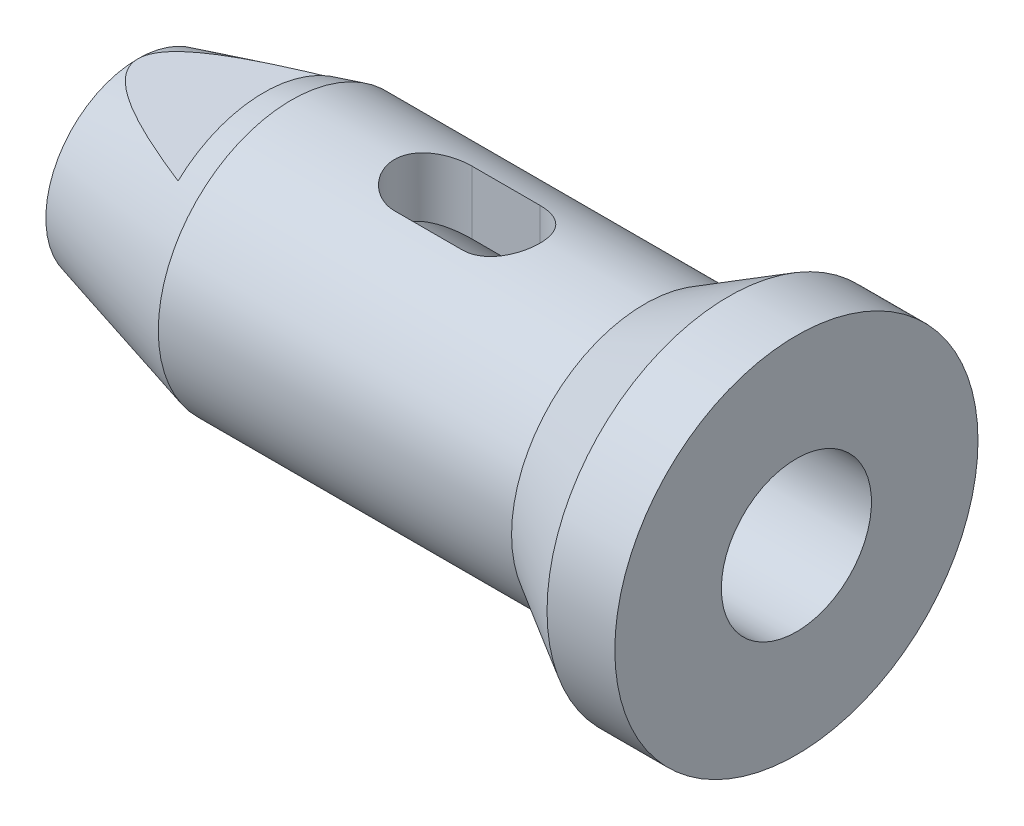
from build123d import *

# Parameters (mm, degrees)
ENL_V_MAT_EXTRU_5_DEPTH      = 73.987156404
ENL_V_MAT_EXTRU_5_DEPTH_BACK = 73.987156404
ESQUISSE7_W                  = 13
ESQUISSE7_H                  = 7.363774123
ESQUISSE7_H_2                = 10.171777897
ENL_V_MAT_EXTRU_6_DEPTH      = 73.987156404
ENL_V_MAT_EXTRU_6_DEPTH_BACK = 73.987156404
ESQUISSE10_R                 = 7.75
ENL_V_MAT_EXTRU_7_DEPTH      = 73.987156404
ESQUISSE11_R                 = 8
ENL_V_MAT_EXTRU_8_DEPTH      = 16
CHANFREIN1_SIZE              = 0.5


with BuildPart() as part:
    # Esquisse2 → R_volution1 (revolve)
    with BuildSketch(Plane.XY, mode=Mode.PRIVATE) as r_volution1_sk:
        Polygon((0, 0), (0, 9.5), (15.861215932, 13.75), (52.339745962, 13.75), (61, 18.75), (68, 18.75), (68, 0), align=None)
    revolve(r_volution1_sk.sketch.rotate(Axis((0, 0, 0), (1, 0, 0)), 90), axis=Axis((0, 0, 0), (1, 0, 0)))

    # Esquisse7 → Enl_v. mat.-Extru.5 (cut, two sides: drawn at the far end of the back side and taken through both)
    with BuildSketch(Plane.XY.offset(-ENL_V_MAT_EXTRU_5_DEPTH_BACK)):
        with Locations((6.5, 13.181887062)):
            Rectangle(ESQUISSE7_W, ESQUISSE7_H)
        with Locations((6.5, -14.585888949)):
            Rectangle(ESQUISSE7_W, ESQUISSE7_H_2)
    extrude(amount=ENL_V_MAT_EXTRU_5_DEPTH + ENL_V_MAT_EXTRU_5_DEPTH_BACK, mode=Mode.SUBTRACT)

    # Esquisse9 → Enl_v. mat.-Extru.6 (cut, two sides: drawn at the far end of the back side and taken through both)
    with BuildSketch(Plane(origin=(0, 0, 0), x_dir=(1, 0, 0), z_dir=(0, 1, 0)).offset(-ENL_V_MAT_EXTRU_6_DEPTH_BACK)):
        with BuildLine():
            Line((37.5, 4), (30.5, 4))
            ThreePointArc((30.5, 4), (26.5, 0), (30.5, -4))
            Line((30.5, -4), (37.5, -4))
            ThreePointArc((37.5, -4), (41.5, 0), (37.5, 4))
        make_face()
    extrude(amount=ENL_V_MAT_EXTRU_6_DEPTH + ENL_V_MAT_EXTRU_6_DEPTH_BACK, mode=Mode.SUBTRACT)

    # Esquisse10 → Enl_v. mat.-Extru.7 (cut, through all)
    with BuildSketch(Plane.ZY):
        Circle(ESQUISSE10_R)
    extrude(amount=-ENL_V_MAT_EXTRU_7_DEPTH, mode=Mode.SUBTRACT)

    # Esquisse11 → Enl_v. mat.-Extru.8 (cut)
    with BuildSketch(Plane.ZY):
        Circle(ESQUISSE11_R)
    extrude(amount=-ENL_V_MAT_EXTRU_8_DEPTH, mode=Mode.SUBTRACT)

    # Chanfrein1
    chanfrein1_edges = [part.edges().sort_by_distance(p)[0] for p in [
        (0, 0, -8),
    ]]
    chamfer(chanfrein1_edges, length=CHANFREIN1_SIZE)


solid = part.part
